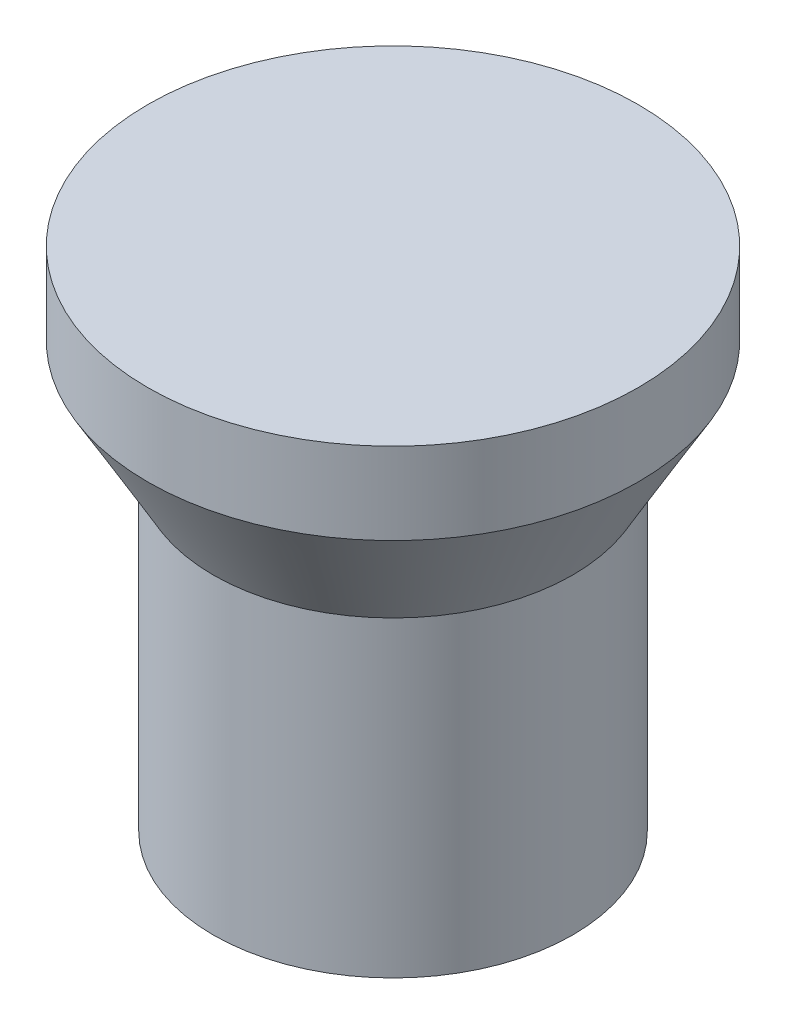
ISO-10303-21;
HEADER;
FILE_DESCRIPTION(('STEP AP214'),'2;1');
FILE_NAME('part.step','',(''),(''),'','','');
FILE_SCHEMA(('AUTOMOTIVE_DESIGN { 1 0 10303 214 1 1 1 1 }'));
ENDSEC;
DATA;
#1=APPLICATION_CONTEXT('core data for automotive mechanical design processes');
#2=APPLICATION_PROTOCOL_DEFINITION('international standard','automotive_design',2000,#1);
#3=PRODUCT_CONTEXT('',#1,'mechanical');
#4=PRODUCT('Part','Part','',(#3));
#5=PRODUCT_RELATED_PRODUCT_CATEGORY('part','',(#4));
#6=PRODUCT_DEFINITION_FORMATION('','',#4);
#7=PRODUCT_DEFINITION_CONTEXT('part definition',#1,'design');
#8=PRODUCT_DEFINITION('design','',#6,#7);
#9=PRODUCT_DEFINITION_SHAPE('','',#8);
#10=(LENGTH_UNIT() NAMED_UNIT(*) SI_UNIT(.MILLI.,.METRE.));
#11=(NAMED_UNIT(*) PLANE_ANGLE_UNIT() SI_UNIT($,.RADIAN.));
#12=(NAMED_UNIT(*) SI_UNIT($,.STERADIAN.) SOLID_ANGLE_UNIT());
#13=UNCERTAINTY_MEASURE_WITH_UNIT(LENGTH_MEASURE(1.E-05),#10,'distance_accuracy_value','');
#14=(GEOMETRIC_REPRESENTATION_CONTEXT(3) GLOBAL_UNCERTAINTY_ASSIGNED_CONTEXT((#13)) GLOBAL_UNIT_ASSIGNED_CONTEXT((#10,
#11,#12)) REPRESENTATION_CONTEXT('',''));
#15=CARTESIAN_POINT('',(0.,0.,0.));
#16=DIRECTION('',(0.,0.,1.));
#17=DIRECTION('',(1.,0.,0.));
#18=AXIS2_PLACEMENT_3D('',#15,#16,#17);
#19=CARTESIAN_POINT('',(0.,1.,0.));
#20=CARTESIAN_POINT('',(6.28603891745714,1.,0.));
#21=CARTESIAN_POINT('',(6.63662740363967,0.954391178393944,0.));
#22=CARTESIAN_POINT('',(9.07621244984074,0.38218995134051,0.));
#23=CARTESIAN_POINT('',(9.,0.252396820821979,0.));
#24=CARTESIAN_POINT('',(9.,0.,0.));
#25=B_SPLINE_CURVE_WITH_KNOTS('',3,(#19,#20,#21,#22,#23,#24),.UNSPECIFIED.,.F.,.F.,(4,1,1,4),
(0.,0.495919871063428,0.595919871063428,1.),.UNSPECIFIED.);
#26=CARTESIAN_POINT('',(0.,36.1553784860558,0.));
#27=DIRECTION('',(0.,1.,0.));
#28=AXIS1_PLACEMENT('',#26,#27);
#29=SURFACE_OF_REVOLUTION('',#25,#28);
#30=CARTESIAN_POINT('',(0.,0.,0.));
#31=DIRECTION('',(0.,1.,0.));
#32=DIRECTION('',(-1.,0.,0.));
#33=AXIS2_PLACEMENT_3D('',#30,#31,#32);
#34=CIRCLE('',#33,9.);
#35=CARTESIAN_POINT('',(-8.99999999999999,0.,0.));
#36=VERTEX_POINT('',#35);
#37=EDGE_CURVE('E11',#36,#36,#34,.T.);
#38=ORIENTED_EDGE('',*,*,#37,.F.);
#39=EDGE_LOOP('',(#38));
#40=FACE_BOUND('',#39,.T.);
#41=CARTESIAN_POINT('',(0.,1.,0.));
#42=VERTEX_POINT('',#41);
#43=VERTEX_LOOP('',#42);
#44=FACE_BOUND('',#43,.T.);
#45=ADVANCED_FACE('F35',(#40,#44),#29,.T.);
#46=CARTESIAN_POINT('',(0.,0.,0.));
#47=DIRECTION('',(0.,1.,0.));
#48=DIRECTION('',(-1.,0.,0.));
#49=AXIS2_PLACEMENT_3D('',#46,#47,#48);
#50=PLANE('',#49);
#51=CARTESIAN_POINT('',(0.,0.,0.));
#52=DIRECTION('',(0.,1.,0.));
#53=DIRECTION('',(-1.,0.,0.));
#54=AXIS2_PLACEMENT_3D('',#51,#52,#53);
#55=CIRCLE('',#54,11.);
#56=CARTESIAN_POINT('',(-11.,0.,0.));
#57=VERTEX_POINT('',#56);
#58=EDGE_CURVE('E42',#57,#57,#55,.T.);
#59=ORIENTED_EDGE('',*,*,#58,.F.);
#60=EDGE_LOOP('',(#59));
#61=FACE_BOUND('',#60,.T.);
#62=ORIENTED_EDGE('',*,*,#37,.T.);
#63=EDGE_LOOP('',(#62));
#64=FACE_BOUND('',#63,.T.);
#65=ADVANCED_FACE('F46',(#61,#64),#50,.F.);
#66=CARTESIAN_POINT('',(0.,36.1553784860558,0.));
#67=DIRECTION('',(0.,1.,0.));
#68=DIRECTION('',(-1.,0.,0.));
#69=AXIS2_PLACEMENT_3D('',#66,#67,#68);
#70=CYLINDRICAL_SURFACE('',#69,11.);
#71=CARTESIAN_POINT('',(0.,19.0717967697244,0.));
#72=DIRECTION('',(0.,1.,0.));
#73=DIRECTION('',(-1.,0.,0.));
#74=AXIS2_PLACEMENT_3D('',#71,#72,#73);
#75=CIRCLE('',#74,11.);
#76=CARTESIAN_POINT('',(-11.,19.0717967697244,0.));
#77=VERTEX_POINT('',#76);
#78=EDGE_CURVE('E81',#77,#77,#75,.T.);
#79=ORIENTED_EDGE('',*,*,#78,.F.);
#80=EDGE_LOOP('',(#79));
#81=FACE_BOUND('',#80,.T.);
#82=ORIENTED_EDGE('',*,*,#58,.T.);
#83=EDGE_LOOP('',(#82));
#84=FACE_BOUND('',#83,.T.);
#85=ADVANCED_FACE('F51',(#81,#84),#70,.T.);
#86=CARTESIAN_POINT('',(0.,19.0717967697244,0.));
#87=DIRECTION('',(0.,1.,0.));
#88=DIRECTION('',(-1.,0.,0.));
#89=AXIS2_PLACEMENT_3D('',#86,#87,#88);
#90=CONICAL_SURFACE('',#89,11.,0.523598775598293);
#91=CARTESIAN_POINT('',(0.,26.,0.));
#92=DIRECTION('',(0.,1.,0.));
#93=DIRECTION('',(-1.,0.,0.));
#94=AXIS2_PLACEMENT_3D('',#91,#92,#93);
#95=CIRCLE('',#94,15.);
#96=CARTESIAN_POINT('',(-15.,26.,0.));
#97=VERTEX_POINT('',#96);
#98=EDGE_CURVE('E78',#97,#97,#95,.T.);
#99=ORIENTED_EDGE('',*,*,#98,.F.);
#100=EDGE_LOOP('',(#99));
#101=FACE_BOUND('',#100,.T.);
#102=ORIENTED_EDGE('',*,*,#78,.T.);
#103=EDGE_LOOP('',(#102));
#104=FACE_BOUND('',#103,.T.);
#105=ADVANCED_FACE('F58',(#101,#104),#90,.T.);
#106=CARTESIAN_POINT('',(0.,36.1553784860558,0.));
#107=DIRECTION('',(0.,1.,0.));
#108=DIRECTION('',(-1.,0.,0.));
#109=AXIS2_PLACEMENT_3D('',#106,#107,#108);
#110=CYLINDRICAL_SURFACE('',#109,15.);
#111=CARTESIAN_POINT('',(0.,31.,0.));
#112=DIRECTION('',(0.,1.,0.));
#113=DIRECTION('',(-1.,0.,0.));
#114=AXIS2_PLACEMENT_3D('',#111,#112,#113);
#115=CIRCLE('',#114,15.);
#116=CARTESIAN_POINT('',(-15.,31.,0.));
#117=VERTEX_POINT('',#116);
#118=EDGE_CURVE('E77',#117,#117,#115,.T.);
#119=ORIENTED_EDGE('',*,*,#118,.F.);
#120=EDGE_LOOP('',(#119));
#121=FACE_BOUND('',#120,.T.);
#122=ORIENTED_EDGE('',*,*,#98,.T.);
#123=EDGE_LOOP('',(#122));
#124=FACE_BOUND('',#123,.T.);
#125=ADVANCED_FACE('F65',(#121,#124),#110,.T.);
#126=CARTESIAN_POINT('',(0.,31.,0.));
#127=DIRECTION('',(0.,-1.,0.));
#128=DIRECTION('',(1.,0.,0.));
#129=AXIS2_PLACEMENT_3D('',#126,#127,#128);
#130=PLANE('',#129);
#131=ORIENTED_EDGE('',*,*,#118,.T.);
#132=EDGE_LOOP('',(#131));
#133=FACE_BOUND('',#132,.T.);
#134=ADVANCED_FACE('F69',(#133),#130,.F.);
#135=CLOSED_SHELL('',(#45,#65,#85,#105,#125,#134));
#136=MANIFOLD_SOLID_BREP('B2',#135);
#137=ADVANCED_BREP_SHAPE_REPRESENTATION('',(#18,#136),#14);
#138=SHAPE_DEFINITION_REPRESENTATION(#9,#137);
ENDSEC;
END-ISO-10303-21;
